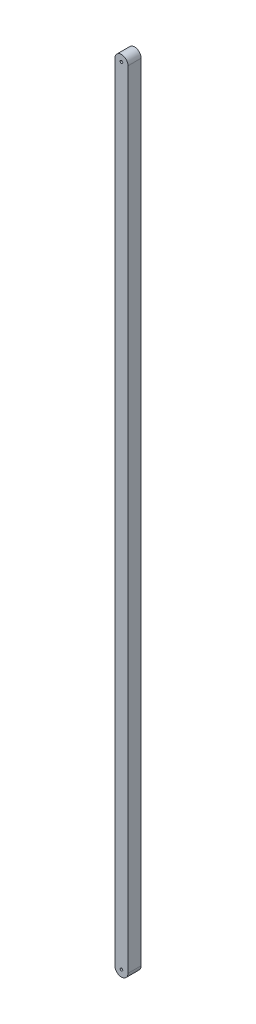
ISO-10303-21;
HEADER;
FILE_DESCRIPTION(('STEP AP214'),'2;1');
FILE_NAME('part.step','',(''),(''),'','','');
FILE_SCHEMA(('AUTOMOTIVE_DESIGN { 1 0 10303 214 1 1 1 1 }'));
ENDSEC;
DATA;
#1=APPLICATION_CONTEXT('core data for automotive mechanical design processes');
#2=APPLICATION_PROTOCOL_DEFINITION('international standard','automotive_design',2000,#1);
#3=PRODUCT_CONTEXT('',#1,'mechanical');
#4=PRODUCT('Part','Part','',(#3));
#5=PRODUCT_RELATED_PRODUCT_CATEGORY('part','',(#4));
#6=PRODUCT_DEFINITION_FORMATION('','',#4);
#7=PRODUCT_DEFINITION_CONTEXT('part definition',#1,'design');
#8=PRODUCT_DEFINITION('design','',#6,#7);
#9=PRODUCT_DEFINITION_SHAPE('','',#8);
#10=(LENGTH_UNIT() NAMED_UNIT(*) SI_UNIT(.MILLI.,.METRE.));
#11=(NAMED_UNIT(*) PLANE_ANGLE_UNIT() SI_UNIT($,.RADIAN.));
#12=(NAMED_UNIT(*) SI_UNIT($,.STERADIAN.) SOLID_ANGLE_UNIT());
#13=UNCERTAINTY_MEASURE_WITH_UNIT(LENGTH_MEASURE(1.E-05),#10,'distance_accuracy_value','');
#14=(GEOMETRIC_REPRESENTATION_CONTEXT(3) GLOBAL_UNCERTAINTY_ASSIGNED_CONTEXT((#13)) GLOBAL_UNIT_ASSIGNED_CONTEXT((#10,
#11,#12)) REPRESENTATION_CONTEXT('',''));
#15=CARTESIAN_POINT('',(0.,0.,0.));
#16=DIRECTION('',(0.,0.,1.));
#17=DIRECTION('',(1.,0.,0.));
#18=AXIS2_PLACEMENT_3D('',#15,#16,#17);
#19=CARTESIAN_POINT('',(0.,30.,0.5));
#20=DIRECTION('',(0.,0.,-1.));
#21=DIRECTION('',(-1.,0.,0.));
#22=AXIS2_PLACEMENT_3D('',#19,#20,#21);
#23=PLANE('',#22);
#24=CARTESIAN_POINT('',(0.,30.,0.5));
#25=DIRECTION('',(0.,0.,1.));
#26=DIRECTION('',(1.,0.,0.));
#27=AXIS2_PLACEMENT_3D('',#24,#25,#26);
#28=CIRCLE('',#27,0.0999999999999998);
#29=CARTESIAN_POINT('',(0.0999999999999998,30.,0.5));
#30=VERTEX_POINT('',#29);
#31=EDGE_CURVE('E97',#30,#30,#28,.T.);
#32=ORIENTED_EDGE('',*,*,#31,.F.);
#33=EDGE_LOOP('',(#32));
#34=FACE_BOUND('',#33,.T.);
#35=CARTESIAN_POINT('',(0.,30.,0.5));
#36=DIRECTION('',(0.,0.,1.));
#37=DIRECTION('',(-1.,0.,0.));
#38=AXIS2_PLACEMENT_3D('',#35,#36,#37);
#39=CIRCLE('',#38,0.5);
#40=CARTESIAN_POINT('',(0.5,30.,0.5));
#41=VERTEX_POINT('',#40);
#42=CARTESIAN_POINT('',(-0.5,30.,0.5));
#43=VERTEX_POINT('',#42);
#44=EDGE_CURVE('E107',#41,#43,#39,.T.);
#45=ORIENTED_EDGE('',*,*,#44,.T.);
#46=DIRECTION('',(0.,-1.,0.));
#47=VECTOR('',#46,1.);
#48=CARTESIAN_POINT('',(-0.5,30.,0.5));
#49=LINE('',#48,#47);
#50=CARTESIAN_POINT('',(-0.5,-30.,0.5));
#51=VERTEX_POINT('',#50);
#52=EDGE_CURVE('E92',#43,#51,#49,.T.);
#53=ORIENTED_EDGE('',*,*,#52,.T.);
#54=CARTESIAN_POINT('',(0.,-30.,0.5));
#55=DIRECTION('',(0.,0.,1.));
#56=DIRECTION('',(1.,0.,0.));
#57=AXIS2_PLACEMENT_3D('',#54,#55,#56);
#58=CIRCLE('',#57,0.5);
#59=CARTESIAN_POINT('',(0.5,-30.,0.5));
#60=VERTEX_POINT('',#59);
#61=EDGE_CURVE('E58',#51,#60,#58,.T.);
#62=ORIENTED_EDGE('',*,*,#61,.T.);
#63=DIRECTION('',(0.,1.,0.));
#64=VECTOR('',#63,1.);
#65=CARTESIAN_POINT('',(0.5,30.,0.5));
#66=LINE('',#65,#64);
#67=EDGE_CURVE('E53',#60,#41,#66,.T.);
#68=ORIENTED_EDGE('',*,*,#67,.T.);
#69=EDGE_LOOP('',(#45,#53,#62,#68));
#70=FACE_BOUND('',#69,.T.);
#71=CARTESIAN_POINT('',(0.,-30.,0.5));
#72=DIRECTION('',(0.,0.,1.));
#73=DIRECTION('',(1.,0.,0.));
#74=AXIS2_PLACEMENT_3D('',#71,#72,#73);
#75=CIRCLE('',#74,0.0999999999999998);
#76=CARTESIAN_POINT('',(0.0999999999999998,-30.,0.5));
#77=VERTEX_POINT('',#76);
#78=EDGE_CURVE('E125',#77,#77,#75,.T.);
#79=ORIENTED_EDGE('',*,*,#78,.F.);
#80=EDGE_LOOP('',(#79));
#81=FACE_BOUND('',#80,.T.);
#82=ADVANCED_FACE('F38',(#34,#70,#81),#23,.F.);
#83=CARTESIAN_POINT('',(0.,30.,-0.5));
#84=DIRECTION('',(0.,0.,-1.));
#85=DIRECTION('',(-1.,0.,0.));
#86=AXIS2_PLACEMENT_3D('',#83,#84,#85);
#87=PLANE('',#86);
#88=CARTESIAN_POINT('',(0.,30.,-0.5));
#89=DIRECTION('',(0.,0.,1.));
#90=DIRECTION('',(1.,0.,0.));
#91=AXIS2_PLACEMENT_3D('',#88,#89,#90);
#92=CIRCLE('',#91,0.0999999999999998);
#93=CARTESIAN_POINT('',(0.0999999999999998,30.,-0.5));
#94=VERTEX_POINT('',#93);
#95=EDGE_CURVE('E100',#94,#94,#92,.T.);
#96=ORIENTED_EDGE('',*,*,#95,.T.);
#97=EDGE_LOOP('',(#96));
#98=FACE_BOUND('',#97,.T.);
#99=CARTESIAN_POINT('',(0.,30.,-0.5));
#100=DIRECTION('',(0.,0.,1.));
#101=DIRECTION('',(-1.,0.,0.));
#102=AXIS2_PLACEMENT_3D('',#99,#100,#101);
#103=CIRCLE('',#102,0.5);
#104=CARTESIAN_POINT('',(0.5,30.,-0.5));
#105=VERTEX_POINT('',#104);
#106=CARTESIAN_POINT('',(-0.5,30.,-0.5));
#107=VERTEX_POINT('',#106);
#108=EDGE_CURVE('E84',#105,#107,#103,.T.);
#109=ORIENTED_EDGE('',*,*,#108,.F.);
#110=DIRECTION('',(0.,1.,0.));
#111=VECTOR('',#110,1.);
#112=CARTESIAN_POINT('',(0.5,30.,-0.5));
#113=LINE('',#112,#111);
#114=CARTESIAN_POINT('',(0.5,-30.,-0.5));
#115=VERTEX_POINT('',#114);
#116=EDGE_CURVE('E105',#115,#105,#113,.T.);
#117=ORIENTED_EDGE('',*,*,#116,.F.);
#118=CARTESIAN_POINT('',(0.,-30.,-0.5));
#119=DIRECTION('',(0.,0.,1.));
#120=DIRECTION('',(1.,0.,0.));
#121=AXIS2_PLACEMENT_3D('',#118,#119,#120);
#122=CIRCLE('',#121,0.5);
#123=CARTESIAN_POINT('',(-0.5,-30.,-0.5));
#124=VERTEX_POINT('',#123);
#125=EDGE_CURVE('E85',#124,#115,#122,.T.);
#126=ORIENTED_EDGE('',*,*,#125,.F.);
#127=DIRECTION('',(0.,-1.,0.));
#128=VECTOR('',#127,1.);
#129=CARTESIAN_POINT('',(-0.5,30.,-0.5));
#130=LINE('',#129,#128);
#131=EDGE_CURVE('E79',#107,#124,#130,.T.);
#132=ORIENTED_EDGE('',*,*,#131,.F.);
#133=EDGE_LOOP('',(#109,#117,#126,#132));
#134=FACE_BOUND('',#133,.T.);
#135=CARTESIAN_POINT('',(0.,-30.,-0.5));
#136=DIRECTION('',(0.,0.,1.));
#137=DIRECTION('',(1.,0.,0.));
#138=AXIS2_PLACEMENT_3D('',#135,#136,#137);
#139=CIRCLE('',#138,0.0999999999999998);
#140=CARTESIAN_POINT('',(0.0999999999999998,-30.,-0.5));
#141=VERTEX_POINT('',#140);
#142=EDGE_CURVE('E127',#141,#141,#139,.T.);
#143=ORIENTED_EDGE('',*,*,#142,.T.);
#144=EDGE_LOOP('',(#143));
#145=FACE_BOUND('',#144,.T.);
#146=ADVANCED_FACE('F80',(#98,#134,#145),#87,.T.);
#147=CARTESIAN_POINT('',(0.,30.,0.5));
#148=DIRECTION('',(0.,0.,-1.));
#149=DIRECTION('',(-1.,0.,0.));
#150=AXIS2_PLACEMENT_3D('',#147,#148,#149);
#151=CYLINDRICAL_SURFACE('',#150,0.5);
#152=ORIENTED_EDGE('',*,*,#108,.T.);
#153=DIRECTION('',(0.,0.,-1.));
#154=VECTOR('',#153,1.);
#155=CARTESIAN_POINT('',(-0.5,30.,0.5));
#156=LINE('',#155,#154);
#157=EDGE_CURVE('E11',#43,#107,#156,.T.);
#158=ORIENTED_EDGE('',*,*,#157,.F.);
#159=ORIENTED_EDGE('',*,*,#44,.F.);
#160=DIRECTION('',(0.,0.,-1.));
#161=VECTOR('',#160,1.);
#162=CARTESIAN_POINT('',(0.5,30.,0.5));
#163=LINE('',#162,#161);
#164=EDGE_CURVE('E96',#41,#105,#163,.T.);
#165=ORIENTED_EDGE('',*,*,#164,.T.);
#166=EDGE_LOOP('',(#152,#158,#159,#165));
#167=FACE_BOUND('',#166,.T.);
#168=ADVANCED_FACE('F40',(#167),#151,.T.);
#169=CARTESIAN_POINT('',(-0.5,30.,0.5));
#170=DIRECTION('',(1.,0.,0.));
#171=DIRECTION('',(0.,0.,-1.));
#172=AXIS2_PLACEMENT_3D('',#169,#170,#171);
#173=PLANE('',#172);
#174=ORIENTED_EDGE('',*,*,#131,.T.);
#175=DIRECTION('',(0.,0.,-1.));
#176=VECTOR('',#175,1.);
#177=CARTESIAN_POINT('',(-0.5,-30.,0.5));
#178=LINE('',#177,#176);
#179=EDGE_CURVE('E46',#51,#124,#178,.T.);
#180=ORIENTED_EDGE('',*,*,#179,.F.);
#181=ORIENTED_EDGE('',*,*,#52,.F.);
#182=ORIENTED_EDGE('',*,*,#157,.T.);
#183=EDGE_LOOP('',(#174,#180,#181,#182));
#184=FACE_BOUND('',#183,.T.);
#185=ADVANCED_FACE('F91',(#184),#173,.F.);
#186=CARTESIAN_POINT('',(0.,-30.,0.5));
#187=DIRECTION('',(0.,0.,-1.));
#188=DIRECTION('',(-1.,0.,0.));
#189=AXIS2_PLACEMENT_3D('',#186,#187,#188);
#190=CYLINDRICAL_SURFACE('',#189,0.5);
#191=ORIENTED_EDGE('',*,*,#125,.T.);
#192=DIRECTION('',(0.,0.,-1.));
#193=VECTOR('',#192,1.);
#194=CARTESIAN_POINT('',(0.5,-30.,0.5));
#195=LINE('',#194,#193);
#196=EDGE_CURVE('E113',#60,#115,#195,.T.);
#197=ORIENTED_EDGE('',*,*,#196,.F.);
#198=ORIENTED_EDGE('',*,*,#61,.F.);
#199=ORIENTED_EDGE('',*,*,#179,.T.);
#200=EDGE_LOOP('',(#191,#197,#198,#199));
#201=FACE_BOUND('',#200,.T.);
#202=ADVANCED_FACE('F116',(#201),#190,.T.);
#203=CARTESIAN_POINT('',(0.5,30.,0.5));
#204=DIRECTION('',(-1.,0.,0.));
#205=DIRECTION('',(0.,0.,1.));
#206=AXIS2_PLACEMENT_3D('',#203,#204,#205);
#207=PLANE('',#206);
#208=ORIENTED_EDGE('',*,*,#116,.T.);
#209=ORIENTED_EDGE('',*,*,#164,.F.);
#210=ORIENTED_EDGE('',*,*,#67,.F.);
#211=ORIENTED_EDGE('',*,*,#196,.T.);
#212=EDGE_LOOP('',(#208,#209,#210,#211));
#213=FACE_BOUND('',#212,.T.);
#214=ADVANCED_FACE('F118',(#213),#207,.F.);
#215=CARTESIAN_POINT('',(0.,30.,0.5));
#216=DIRECTION('',(0.,0.,-1.));
#217=DIRECTION('',(-1.,0.,0.));
#218=AXIS2_PLACEMENT_3D('',#215,#216,#217);
#219=CYLINDRICAL_SURFACE('',#218,0.0999999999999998);
#220=ORIENTED_EDGE('',*,*,#31,.T.);
#221=EDGE_LOOP('',(#220));
#222=FACE_BOUND('',#221,.T.);
#223=ORIENTED_EDGE('',*,*,#95,.F.);
#224=EDGE_LOOP('',(#223));
#225=FACE_BOUND('',#224,.T.);
#226=ADVANCED_FACE('F136',(#222,#225),#219,.F.);
#227=CARTESIAN_POINT('',(0.,-30.,0.5));
#228=DIRECTION('',(0.,0.,-1.));
#229=DIRECTION('',(-1.,0.,0.));
#230=AXIS2_PLACEMENT_3D('',#227,#228,#229);
#231=CYLINDRICAL_SURFACE('',#230,0.0999999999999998);
#232=ORIENTED_EDGE('',*,*,#78,.T.);
#233=EDGE_LOOP('',(#232));
#234=FACE_BOUND('',#233,.T.);
#235=ORIENTED_EDGE('',*,*,#142,.F.);
#236=EDGE_LOOP('',(#235));
#237=FACE_BOUND('',#236,.T.);
#238=ADVANCED_FACE('F134',(#234,#237),#231,.F.);
#239=CLOSED_SHELL('',(#82,#146,#168,#185,#202,#214,#226,#238));
#240=MANIFOLD_SOLID_BREP('B2',#239);
#241=ADVANCED_BREP_SHAPE_REPRESENTATION('',(#18,#240),#14);
#242=SHAPE_DEFINITION_REPRESENTATION(#9,#241);
ENDSEC;
END-ISO-10303-21;
